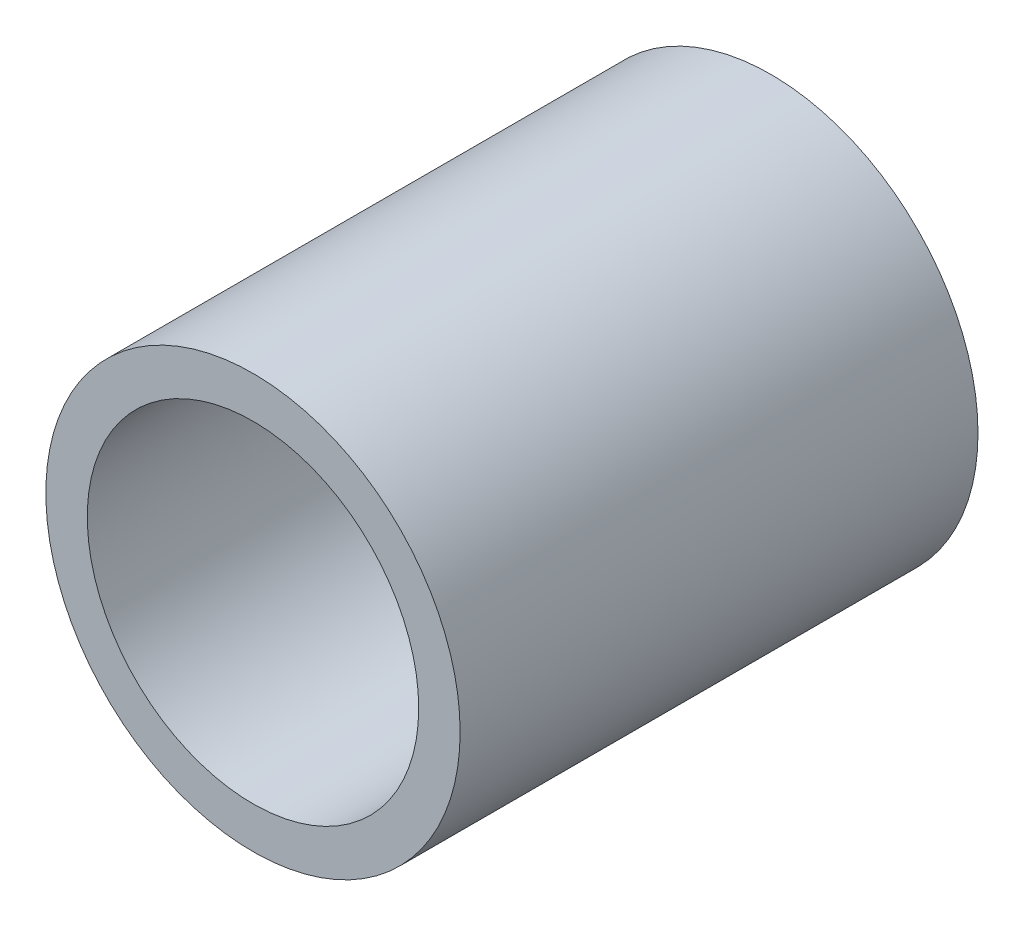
from build123d import *

# Parameters (mm, degrees)
SKETCH_1_R      = 5
SKETCH_1_R_2    = 4
EXTRUDE_1_DEPTH = 12.5


with BuildPart() as part:
    # Sketch 1 → Extrude 1 (new body)
    with BuildSketch(Plane.XY):
        Circle(SKETCH_1_R)
        Circle(SKETCH_1_R_2, mode=Mode.SUBTRACT)
    extrude(amount=EXTRUDE_1_DEPTH)


solid = part.part
